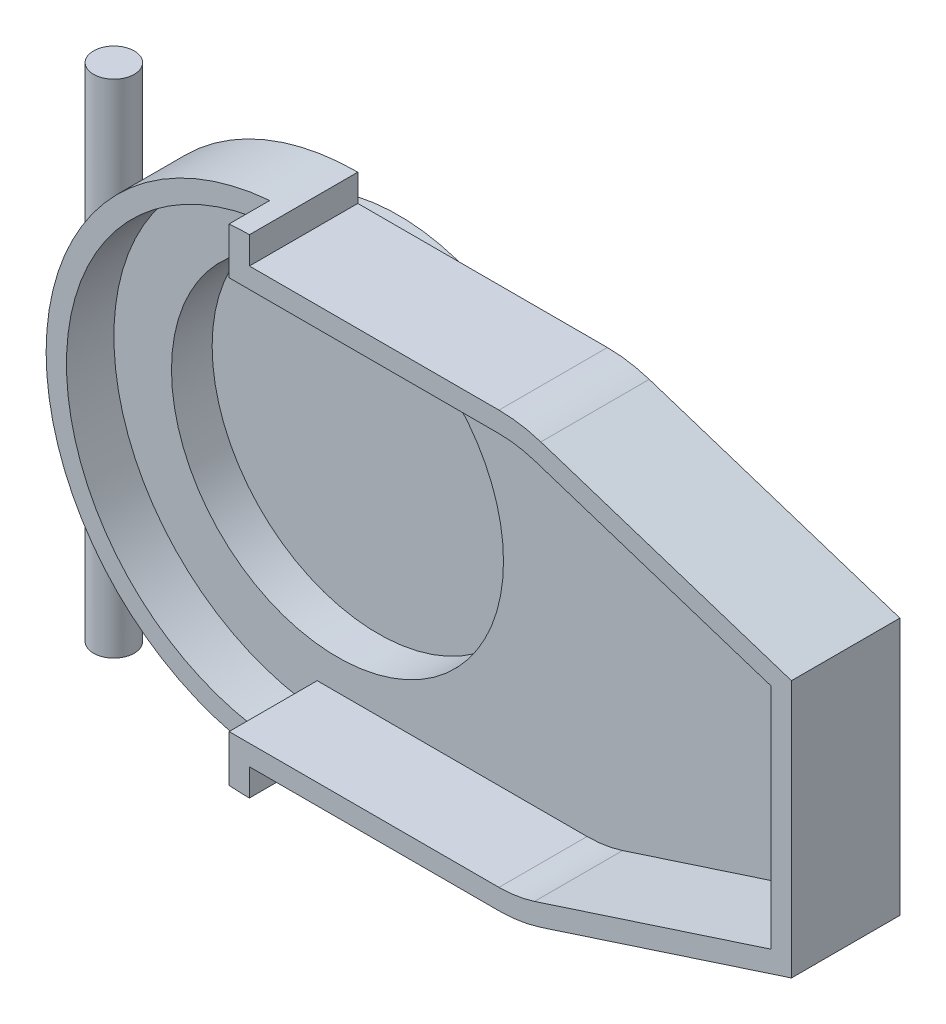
ISO-10303-21;
HEADER;
FILE_DESCRIPTION(('STEP AP214'),'2;1');
FILE_NAME('part.step','',(''),(''),'','','');
FILE_SCHEMA(('AUTOMOTIVE_DESIGN { 1 0 10303 214 1 1 1 1 }'));
ENDSEC;
DATA;
#1=APPLICATION_CONTEXT('core data for automotive mechanical design processes');
#2=APPLICATION_PROTOCOL_DEFINITION('international standard','automotive_design',2000,#1);
#3=PRODUCT_CONTEXT('',#1,'mechanical');
#4=PRODUCT('Part','Part','',(#3));
#5=PRODUCT_RELATED_PRODUCT_CATEGORY('part','',(#4));
#6=PRODUCT_DEFINITION_FORMATION('','',#4);
#7=PRODUCT_DEFINITION_CONTEXT('part definition',#1,'design');
#8=PRODUCT_DEFINITION('design','',#6,#7);
#9=PRODUCT_DEFINITION_SHAPE('','',#8);
#10=(LENGTH_UNIT() NAMED_UNIT(*) SI_UNIT(.MILLI.,.METRE.));
#11=(NAMED_UNIT(*) PLANE_ANGLE_UNIT() SI_UNIT($,.RADIAN.));
#12=(NAMED_UNIT(*) SI_UNIT($,.STERADIAN.) SOLID_ANGLE_UNIT());
#13=UNCERTAINTY_MEASURE_WITH_UNIT(LENGTH_MEASURE(1.E-05),#10,'distance_accuracy_value','');
#14=(GEOMETRIC_REPRESENTATION_CONTEXT(3) GLOBAL_UNCERTAINTY_ASSIGNED_CONTEXT((#13)) GLOBAL_UNIT_ASSIGNED_CONTEXT((#10,
#11,#12)) REPRESENTATION_CONTEXT('',''));
#15=CARTESIAN_POINT('',(0.,0.,0.));
#16=DIRECTION('',(0.,0.,1.));
#17=DIRECTION('',(1.,0.,0.));
#18=AXIS2_PLACEMENT_3D('',#15,#16,#17);
#19=CARTESIAN_POINT('',(0.,0.,10.9999999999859));
#20=DIRECTION('',(0.,0.,-1.));
#21=DIRECTION('',(-1.,0.,0.));
#22=AXIS2_PLACEMENT_3D('',#19,#20,#21);
#23=CYLINDRICAL_SURFACE('',#22,18.);
#24=CARTESIAN_POINT('',(0.,0.,10.9999999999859));
#25=DIRECTION('',(0.,0.,1.));
#26=DIRECTION('',(1.,0.,0.));
#27=AXIS2_PLACEMENT_3D('',#24,#25,#26);
#28=CIRCLE('',#27,18.);
#29=CARTESIAN_POINT('',(-1.5,-17.9373911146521,10.9999999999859));
#30=VERTEX_POINT('',#29);
#31=CARTESIAN_POINT('',(0.,-18.,10.9999999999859));
#32=VERTEX_POINT('',#31);
#33=EDGE_CURVE('E205',#30,#32,#28,.T.);
#34=ORIENTED_EDGE('',*,*,#33,.F.);
#35=DIRECTION('',(0.,0.,-1.));
#36=VECTOR('',#35,1.);
#37=CARTESIAN_POINT('',(-1.5,-17.9373911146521,10.9999999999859));
#38=LINE('',#37,#36);
#39=CARTESIAN_POINT('',(-1.5,-17.9373911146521,7.9999999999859));
#40=VERTEX_POINT('',#39);
#41=EDGE_CURVE('E197',#30,#40,#38,.T.);
#42=ORIENTED_EDGE('',*,*,#41,.T.);
#43=CARTESIAN_POINT('',(0.,0.,7.9999999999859));
#44=DIRECTION('',(0.,0.,-1.));
#45=DIRECTION('',(-1.,0.,0.));
#46=AXIS2_PLACEMENT_3D('',#43,#44,#45);
#47=CIRCLE('',#46,18.);
#48=CARTESIAN_POINT('',(-1.5,17.9373911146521,7.9999999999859));
#49=VERTEX_POINT('',#48);
#50=EDGE_CURVE('E183',#40,#49,#47,.T.);
#51=ORIENTED_EDGE('',*,*,#50,.T.);
#52=DIRECTION('',(0.,0.,-1.));
#53=VECTOR('',#52,1.);
#54=CARTESIAN_POINT('',(-1.5,17.9373911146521,10.9999999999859));
#55=LINE('',#54,#53);
#56=CARTESIAN_POINT('',(-1.5,17.9373911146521,10.9999999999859));
#57=VERTEX_POINT('',#56);
#58=EDGE_CURVE('E201',#49,#57,#55,.F.);
#59=ORIENTED_EDGE('',*,*,#58,.T.);
#60=CARTESIAN_POINT('',(0.,18.,10.9999999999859));
#61=VERTEX_POINT('',#60);
#62=EDGE_CURVE('E318',#61,#57,#28,.T.);
#63=ORIENTED_EDGE('',*,*,#62,.F.);
#64=DIRECTION('',(0.,0.,-1.));
#65=VECTOR('',#64,1.);
#66=CARTESIAN_POINT('',(0.,18.,10.9999999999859));
#67=LINE('',#66,#65);
#68=CARTESIAN_POINT('',(0.,18.,2.9999999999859));
#69=VERTEX_POINT('',#68);
#70=EDGE_CURVE('E334',#61,#69,#67,.T.);
#71=ORIENTED_EDGE('',*,*,#70,.T.);
#72=CARTESIAN_POINT('',(0.,0.,2.9999999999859));
#73=DIRECTION('',(0.,0.,1.));
#74=DIRECTION('',(1.,0.,0.));
#75=AXIS2_PLACEMENT_3D('',#72,#73,#74);
#76=CIRCLE('',#75,18.);
#77=CARTESIAN_POINT('',(0.,-18.,2.9999999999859));
#78=VERTEX_POINT('',#77);
#79=EDGE_CURVE('E297',#69,#78,#76,.T.);
#80=ORIENTED_EDGE('',*,*,#79,.T.);
#81=DIRECTION('',(0.,0.,-1.));
#82=VECTOR('',#81,1.);
#83=CARTESIAN_POINT('',(0.,-18.,10.9999999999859));
#84=LINE('',#83,#82);
#85=EDGE_CURVE('E331',#32,#78,#84,.T.);
#86=ORIENTED_EDGE('',*,*,#85,.F.);
#87=EDGE_LOOP('',(#34,#42,#51,#59,#63,#71,#80,#86));
#88=FACE_BOUND('',#87,.T.);
#89=CARTESIAN_POINT('',(-15.5,9.15150260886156,6.99999999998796));
#90=CARTESIAN_POINT('',(-15.4350245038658,9.26155332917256,6.99999762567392));
#91=CARTESIAN_POINT('',(-15.3688756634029,9.37090868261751,6.99579099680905));
#92=CARTESIAN_POINT('',(-15.2345694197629,9.58770806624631,6.97788420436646));
#93=CARTESIAN_POINT('',(-15.1664111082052,9.69515119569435,6.96417968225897));
#94=CARTESIAN_POINT('',(-15.0291509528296,9.90658424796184,6.92595522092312));
#95=CARTESIAN_POINT('',(-14.9600573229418,10.0105911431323,6.90150128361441));
#96=CARTESIAN_POINT('',(-14.8215769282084,10.214498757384,6.83995542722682));
#97=CARTESIAN_POINT('',(-14.7521907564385,10.3144053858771,6.80288246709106));
#98=CARTESIAN_POINT('',(-14.6321997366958,10.4836352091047,6.72501066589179));
#99=CARTESIAN_POINT('',(-14.5813033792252,10.5542780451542,6.68755332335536));
#100=CARTESIAN_POINT('',(-14.4812623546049,10.6911278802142,6.60293755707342));
#101=CARTESIAN_POINT('',(-14.4321198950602,10.7573293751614,6.55576738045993));
#102=CARTESIAN_POINT('',(-14.336820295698,10.8840218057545,6.44981805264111));
#103=CARTESIAN_POINT('',(-14.2907023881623,10.944441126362,6.39091574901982));
#104=CARTESIAN_POINT('',(-14.2048403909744,11.055650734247,6.26065751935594));
#105=CARTESIAN_POINT('',(-14.1650768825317,11.1064704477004,6.18934098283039));
#106=CARTESIAN_POINT('',(-14.1085420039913,11.1781177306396,6.06278556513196));
#107=CARTESIAN_POINT('',(-14.0886928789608,11.2031020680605,6.01127888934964));
#108=CARTESIAN_POINT('',(-14.0542751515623,11.246248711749,5.90379943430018));
#109=CARTESIAN_POINT('',(-14.0397025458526,11.2644161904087,5.84783008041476));
#110=CARTESIAN_POINT('',(-14.0168906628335,11.2927905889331,5.73213250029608));
#111=CARTESIAN_POINT('',(-14.0087022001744,11.3029336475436,5.67237812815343));
#112=CARTESIAN_POINT('',(-13.9996612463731,11.3141301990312,5.55147615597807));
#113=CARTESIAN_POINT('',(-13.9988046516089,11.3151887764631,5.49032935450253));
#114=CARTESIAN_POINT('',(-14.0041817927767,11.3085322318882,5.3756822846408));
#115=CARTESIAN_POINT('',(-14.0096412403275,11.3017752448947,5.3220847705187));
#116=CARTESIAN_POINT('',(-14.0259693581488,11.2815048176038,5.21705139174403));
#117=CARTESIAN_POINT('',(-14.0368390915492,11.2679900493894,5.16561595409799));
#118=CARTESIAN_POINT('',(-14.0636005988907,11.2345717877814,5.06460991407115));
#119=CARTESIAN_POINT('',(-14.0796225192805,11.2145024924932,5.01512976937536));
#120=CARTESIAN_POINT('',(-14.1156458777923,11.1691263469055,4.92021975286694));
#121=CARTESIAN_POINT('',(-14.1356491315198,11.1438171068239,4.87479174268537));
#122=CARTESIAN_POINT('',(-14.1919249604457,11.0721451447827,4.76175191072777));
#123=CARTESIAN_POINT('',(-14.230672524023,11.0223647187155,4.69753657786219));
#124=CARTESIAN_POINT('',(-14.313236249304,10.9149384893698,4.57978643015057));
#125=CARTESIAN_POINT('',(-14.3570663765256,10.8572709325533,4.52628219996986));
#126=CARTESIAN_POINT('',(-14.4378285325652,10.7495402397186,4.43957851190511));
#127=CARTESIAN_POINT('',(-14.474194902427,10.7005404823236,4.40449205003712));
#128=CARTESIAN_POINT('',(-14.5480715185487,10.5998832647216,4.33972208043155));
#129=CARTESIAN_POINT('',(-14.5855824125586,10.5482242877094,4.31004170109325));
#130=CARTESIAN_POINT('',(-14.6991063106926,10.3900455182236,4.22826955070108));
#131=CARTESIAN_POINT('',(-14.7760610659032,10.2803895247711,4.18349679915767));
#132=CARTESIAN_POINT('',(-14.9178497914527,10.073284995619,4.11570531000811));
#133=CARTESIAN_POINT('',(-14.982721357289,9.97656445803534,4.09039558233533));
#134=CARTESIAN_POINT('',(-15.1115196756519,9.78037499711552,4.04960429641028));
#135=CARTESIAN_POINT('',(-15.1754457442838,9.68090422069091,4.03412954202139));
#136=CARTESIAN_POINT('',(-15.3018281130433,9.47988329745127,4.01176189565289));
#137=CARTESIAN_POINT('',(-15.364281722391,9.37832989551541,4.00488367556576));
#138=CARTESIAN_POINT('',(-15.4872600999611,9.1738227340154,3.99879188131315));
#139=CARTESIAN_POINT('',(-15.5477843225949,9.07086858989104,3.99958045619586));
#140=CARTESIAN_POINT('',(-15.6957543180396,8.81333350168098,4.01017734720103));
#141=CARTESIAN_POINT('',(-15.7818732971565,8.65815416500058,4.02421255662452));
#142=CARTESIAN_POINT('',(-15.948789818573,8.34669862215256,4.06612570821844));
#143=CARTESIAN_POINT('',(-16.0295827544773,8.19042159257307,4.09401545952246));
#144=CARTESIAN_POINT('',(-16.1856318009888,7.87755746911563,4.16312951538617));
#145=CARTESIAN_POINT('',(-16.2608752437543,7.72097045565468,4.20438323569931));
#146=CARTESIAN_POINT('',(-16.3691032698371,7.48731174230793,4.27667301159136));
#147=CARTESIAN_POINT('',(-16.4043923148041,7.40966209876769,4.30249120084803));
#148=CARTESIAN_POINT('',(-16.4733794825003,7.25499342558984,4.35785645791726));
#149=CARTESIAN_POINT('',(-16.5070778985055,7.17797428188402,4.38740283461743));
#150=CARTESIAN_POINT('',(-16.5718597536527,7.02709134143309,4.44972410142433));
#151=CARTESIAN_POINT('',(-16.6029903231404,6.9532001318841,4.48238315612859));
#152=CARTESIAN_POINT('',(-16.663559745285,6.80676522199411,4.55222863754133));
#153=CARTESIAN_POINT('',(-16.6929971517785,6.73422270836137,4.58941885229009));
#154=CARTESIAN_POINT('',(-16.7497334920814,6.59183324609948,4.66901086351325));
#155=CARTESIAN_POINT('',(-16.7770447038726,6.52197222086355,4.71137843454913));
#156=CARTESIAN_POINT('',(-16.8292640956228,6.38601015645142,4.80297208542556));
#157=CARTESIAN_POINT('',(-16.8541773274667,6.31990133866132,4.85218318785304));
#158=CARTESIAN_POINT('',(-16.8926373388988,6.2161672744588,4.94140444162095));
#159=CARTESIAN_POINT('',(-16.9071362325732,6.17659560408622,4.97871453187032));
#160=CARTESIAN_POINT('',(-16.934152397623,6.10213331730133,5.05843609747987));
#161=CARTESIAN_POINT('',(-16.9466737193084,6.06723315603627,5.10083682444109));
#162=CARTESIAN_POINT('',(-16.9646180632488,6.0168237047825,5.17480816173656));
#163=CARTESIAN_POINT('',(-16.9709465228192,5.99893768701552,5.20451784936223));
#164=CARTESIAN_POINT('',(-16.9820356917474,5.96747358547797,5.26643011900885));
#165=CARTESIAN_POINT('',(-16.9867987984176,5.9538889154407,5.29862879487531));
#166=CARTESIAN_POINT('',(-16.9936412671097,5.93432777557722,5.35930118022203));
#167=CARTESIAN_POINT('',(-16.9960448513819,5.92743467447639,5.3874374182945));
#168=CARTESIAN_POINT('',(-16.9992459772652,5.91824814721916,5.44453622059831));
#169=CARTESIAN_POINT('',(-17.0000452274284,5.915949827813,5.4734978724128));
#170=CARTESIAN_POINT('',(-16.9999507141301,5.91622140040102,5.53143693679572));
#171=CARTESIAN_POINT('',(-16.9990545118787,5.91879830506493,5.56041431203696));
#172=CARTESIAN_POINT('',(-16.9956654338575,5.92852273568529,5.61749705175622));
#173=CARTESIAN_POINT('',(-16.9931708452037,5.93567516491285,5.64560144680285));
#174=CARTESIAN_POINT('',(-16.9857425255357,5.95690466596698,5.70959148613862));
#175=CARTESIAN_POINT('',(-16.9802697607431,5.97250402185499,5.74490244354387));
#176=CARTESIAN_POINT('',(-16.9674950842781,6.00870051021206,5.81248650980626));
#177=CARTESIAN_POINT('',(-16.9601887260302,6.02930978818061,5.8447519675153));
#178=CARTESIAN_POINT('',(-16.9380720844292,6.09126059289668,5.93030094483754));
#179=CARTESIAN_POINT('',(-16.9218339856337,6.1362930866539,5.98049899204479));
#180=CARTESIAN_POINT('',(-16.8867664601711,6.23215613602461,6.07390296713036));
#181=CARTESIAN_POINT('',(-16.8679286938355,6.28300525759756,6.11708537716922));
#182=CARTESIAN_POINT('',(-16.8199182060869,6.4106756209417,6.21552927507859));
#183=CARTESIAN_POINT('',(-16.7897841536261,6.4892640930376,6.26800206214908));
#184=CARTESIAN_POINT('',(-16.7267258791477,6.65012536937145,6.36514740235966));
#185=CARTESIAN_POINT('',(-16.6937961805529,6.73240524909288,6.40980409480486));
#186=CARTESIAN_POINT('',(-16.6254597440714,6.89943926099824,6.49310209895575));
#187=CARTESIAN_POINT('',(-16.5900429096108,6.98420255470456,6.53171656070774));
#188=CARTESIAN_POINT('',(-16.5171248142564,7.15494329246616,6.60366261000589));
#189=CARTESIAN_POINT('',(-16.4796251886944,7.24091974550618,6.63699826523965));
#190=CARTESIAN_POINT('',(-16.3738349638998,7.47828972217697,6.72225462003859));
#191=CARTESIAN_POINT('',(-16.3034997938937,7.63049634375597,6.76941822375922));
#192=CARTESIAN_POINT('',(-16.157139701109,7.93571333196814,6.85098865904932));
#193=CARTESIAN_POINT('',(-16.0811097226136,8.08872429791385,6.88538398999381));
#194=CARTESIAN_POINT('',(-15.9237240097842,8.39431600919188,6.94132950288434));
#195=CARTESIAN_POINT('',(-15.8423697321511,8.54689686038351,6.9628831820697));
#196=CARTESIAN_POINT('',(-15.6747326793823,8.85058156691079,6.99221497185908));
#197=CARTESIAN_POINT('',(-15.5884535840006,9.00168642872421,7.00000323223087));
#198=CARTESIAN_POINT('',(-15.5,9.15150260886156,6.99999999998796));
#199=B_SPLINE_CURVE_WITH_KNOTS('',3,(#89,#90,#91,#92,#93,#94,#95,#96,#97,#98,#99,#100,#101,#102,
#103,#104,#105,#106,#107,#108,#109,#110,#111,#112,#113,#114,#115,#116,#117,#118,#119,#120,#121,
#122,#123,#124,#125,#126,#127,#128,#129,#130,#131,#132,#133,#134,#135,#136,#137,#138,#139,#140,
#141,#142,#143,#144,#145,#146,#147,#148,#149,#150,#151,#152,#153,#154,#155,#156,#157,#158,#159,
#160,#161,#162,#163,#164,#165,#166,#167,#168,#169,#170,#171,#172,#173,#174,#175,#176,#177,#178,
#179,#180,#181,#182,#183,#184,#185,#186,#187,#188,#189,#190,#191,#192,#193,#194,#195,#196,#197,
#198),.UNSPECIFIED.,.T.,.F.,(4,2,2,2,2,2,2,2,2,2,2,2,2,2,2,2,2,2,2,2,2,2,2,2,2,2,2,2,2,2,2,2,2,
2,2,2,2,2,2,2,2,2,2,2,2,2,2,2,2,2,2,2,2,2,4),(0.,0.383303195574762,0.766782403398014,
1.14793922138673,1.52852589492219,1.81238746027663,2.09659454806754,2.38395915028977,
2.67042805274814,2.85154872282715,3.0325316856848,3.21494088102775,3.39724797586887,
3.55937668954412,3.72153727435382,3.88816682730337,4.05487254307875,4.32339325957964,
4.59267010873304,4.80354433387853,5.01454020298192,5.43681733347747,5.7939202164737,
6.15126987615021,6.50922860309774,6.86728767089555,7.4006461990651,7.93446012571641,
8.46945711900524,8.73672702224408,9.00394745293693,9.26356169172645,9.52339447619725,
9.78159413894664,10.0392373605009,10.2078165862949,10.376045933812,10.4815145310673,
10.5868208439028,10.6736531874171,10.7603930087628,10.8472576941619,10.9342156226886,
11.0505186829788,11.1671065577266,11.3740300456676,11.581633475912,11.8784921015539,
12.1759463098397,12.4746869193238,12.7731961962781,13.2950598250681,13.8173923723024,
14.3395826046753,14.8613876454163),.UNSPECIFIED.);
#200=CARTESIAN_POINT('',(-15.5,9.15150260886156,6.99999999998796));
#201=VERTEX_POINT('',#200);
#202=EDGE_CURVE('E487',#201,#201,#199,.T.);
#203=ORIENTED_EDGE('',*,*,#202,.F.);
#204=EDGE_LOOP('',(#203));
#205=FACE_BOUND('',#204,.T.);
#206=CARTESIAN_POINT('',(-15.5,-9.15150260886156,3.99999999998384));
#207=CARTESIAN_POINT('',(-15.4350245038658,-9.26155332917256,4.00000237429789));
#208=CARTESIAN_POINT('',(-15.3688756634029,-9.37090868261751,4.00420900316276));
#209=CARTESIAN_POINT('',(-15.2345694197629,-9.58770806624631,4.02211579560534));
#210=CARTESIAN_POINT('',(-15.1664111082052,-9.69515119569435,4.03582031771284));
#211=CARTESIAN_POINT('',(-15.0291509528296,-9.90658424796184,4.07404477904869));
#212=CARTESIAN_POINT('',(-14.9600573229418,-10.0105911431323,4.0984987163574));
#213=CARTESIAN_POINT('',(-14.8215769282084,-10.214498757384,4.16004457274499));
#214=CARTESIAN_POINT('',(-14.7521907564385,-10.3144053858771,4.19711753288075));
#215=CARTESIAN_POINT('',(-14.6321997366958,-10.4836352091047,4.27498933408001));
#216=CARTESIAN_POINT('',(-14.5813033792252,-10.5542780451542,4.31244667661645));
#217=CARTESIAN_POINT('',(-14.4812623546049,-10.6911278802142,4.39706244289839));
#218=CARTESIAN_POINT('',(-14.4321198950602,-10.7573293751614,4.44423261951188));
#219=CARTESIAN_POINT('',(-14.336820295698,-10.8840218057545,4.5501819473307));
#220=CARTESIAN_POINT('',(-14.2907023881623,-10.944441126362,4.60908425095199));
#221=CARTESIAN_POINT('',(-14.2048403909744,-11.055650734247,4.73934248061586));
#222=CARTESIAN_POINT('',(-14.1650768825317,-11.1064704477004,4.81065901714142));
#223=CARTESIAN_POINT('',(-14.1085420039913,-11.1781177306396,4.93721443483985));
#224=CARTESIAN_POINT('',(-14.0886928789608,-11.2031020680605,4.98872111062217));
#225=CARTESIAN_POINT('',(-14.0542751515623,-11.246248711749,5.09620056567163));
#226=CARTESIAN_POINT('',(-14.0397025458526,-11.2644161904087,5.15216991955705));
#227=CARTESIAN_POINT('',(-14.0168906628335,-11.2927905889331,5.26786749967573));
#228=CARTESIAN_POINT('',(-14.0087022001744,-11.3029336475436,5.32762187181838));
#229=CARTESIAN_POINT('',(-13.9996612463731,-11.3141301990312,5.44852384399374));
#230=CARTESIAN_POINT('',(-13.9988046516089,-11.3151887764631,5.50967064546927));
#231=CARTESIAN_POINT('',(-14.0041817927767,-11.3085322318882,5.62431771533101));
#232=CARTESIAN_POINT('',(-14.0096412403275,-11.3017752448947,5.6779152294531));
#233=CARTESIAN_POINT('',(-14.0259693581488,-11.2815048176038,5.78294860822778));
#234=CARTESIAN_POINT('',(-14.0368390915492,-11.2679900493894,5.83438404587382));
#235=CARTESIAN_POINT('',(-14.0636005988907,-11.2345717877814,5.93539008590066));
#236=CARTESIAN_POINT('',(-14.0796225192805,-11.2145024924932,5.98487023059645));
#237=CARTESIAN_POINT('',(-14.1156458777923,-11.1691263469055,6.07978024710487));
#238=CARTESIAN_POINT('',(-14.1356491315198,-11.1438171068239,6.12520825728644));
#239=CARTESIAN_POINT('',(-14.1919249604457,-11.0721451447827,6.23824808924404));
#240=CARTESIAN_POINT('',(-14.230672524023,-11.0223647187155,6.30246342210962));
#241=CARTESIAN_POINT('',(-14.313236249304,-10.9149384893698,6.42021356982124));
#242=CARTESIAN_POINT('',(-14.3570663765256,-10.8572709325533,6.47371780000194));
#243=CARTESIAN_POINT('',(-14.4378285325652,-10.7495402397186,6.5604214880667));
#244=CARTESIAN_POINT('',(-14.474194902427,-10.7005404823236,6.59550794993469));
#245=CARTESIAN_POINT('',(-14.5480715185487,-10.5998832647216,6.66027791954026));
#246=CARTESIAN_POINT('',(-14.5855824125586,-10.5482242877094,6.68995829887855));
#247=CARTESIAN_POINT('',(-14.6991063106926,-10.3900455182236,6.77173044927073));
#248=CARTESIAN_POINT('',(-14.7760610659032,-10.2803895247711,6.81650320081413));
#249=CARTESIAN_POINT('',(-14.9178497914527,-10.073284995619,6.8842946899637));
#250=CARTESIAN_POINT('',(-14.982721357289,-9.97656445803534,6.90960441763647));
#251=CARTESIAN_POINT('',(-15.1115196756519,-9.78037499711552,6.95039570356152));
#252=CARTESIAN_POINT('',(-15.1754457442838,-9.68090422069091,6.96587045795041));
#253=CARTESIAN_POINT('',(-15.3018281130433,-9.47988329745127,6.98823810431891));
#254=CARTESIAN_POINT('',(-15.364281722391,-9.37832989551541,6.99511632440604));
#255=CARTESIAN_POINT('',(-15.4872600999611,-9.1738227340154,7.00120811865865));
#256=CARTESIAN_POINT('',(-15.5477843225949,-9.07086858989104,7.00041954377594));
#257=CARTESIAN_POINT('',(-15.6957543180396,-8.81333350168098,6.98982265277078));
#258=CARTESIAN_POINT('',(-15.7818732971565,-8.65815416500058,6.97578744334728));
#259=CARTESIAN_POINT('',(-15.948789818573,-8.34669862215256,6.93387429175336));
#260=CARTESIAN_POINT('',(-16.0295827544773,-8.19042159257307,6.90598454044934));
#261=CARTESIAN_POINT('',(-16.1856318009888,-7.87755746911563,6.83687048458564));
#262=CARTESIAN_POINT('',(-16.2608752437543,-7.72097045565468,6.7956167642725));
#263=CARTESIAN_POINT('',(-16.3691032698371,-7.48731174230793,6.72332698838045));
#264=CARTESIAN_POINT('',(-16.4043923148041,-7.40966209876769,6.69750879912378));
#265=CARTESIAN_POINT('',(-16.4733794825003,-7.25499342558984,6.64214354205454));
#266=CARTESIAN_POINT('',(-16.5070778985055,-7.17797428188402,6.61259716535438));
#267=CARTESIAN_POINT('',(-16.5718597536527,-7.02709134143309,6.55027589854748));
#268=CARTESIAN_POINT('',(-16.6029903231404,-6.9532001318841,6.51761684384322));
#269=CARTESIAN_POINT('',(-16.663559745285,-6.80676522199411,6.44777136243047));
#270=CARTESIAN_POINT('',(-16.6929971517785,-6.73422270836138,6.41058114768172));
#271=CARTESIAN_POINT('',(-16.7497334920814,-6.59183324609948,6.33098913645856));
#272=CARTESIAN_POINT('',(-16.7770447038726,-6.52197222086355,6.28862156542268));
#273=CARTESIAN_POINT('',(-16.8292640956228,-6.38601015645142,6.19702791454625));
#274=CARTESIAN_POINT('',(-16.8541773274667,-6.31990133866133,6.14781681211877));
#275=CARTESIAN_POINT('',(-16.8926373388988,-6.2161672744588,6.05859555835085));
#276=CARTESIAN_POINT('',(-16.9071362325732,-6.17659560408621,6.02128546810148));
#277=CARTESIAN_POINT('',(-16.934152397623,-6.10213331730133,5.94156390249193));
#278=CARTESIAN_POINT('',(-16.9466737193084,-6.06723315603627,5.89916317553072));
#279=CARTESIAN_POINT('',(-16.9646180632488,-6.0168237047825,5.82519183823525));
#280=CARTESIAN_POINT('',(-16.9709465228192,-5.99893768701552,5.79548215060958));
#281=CARTESIAN_POINT('',(-16.9820356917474,-5.96747358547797,5.73356988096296));
#282=CARTESIAN_POINT('',(-16.9867987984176,-5.9538889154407,5.70137120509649));
#283=CARTESIAN_POINT('',(-16.9936412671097,-5.93432777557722,5.64069881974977));
#284=CARTESIAN_POINT('',(-16.9960448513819,-5.92743467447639,5.61256258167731));
#285=CARTESIAN_POINT('',(-16.9992459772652,-5.91824814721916,5.55546377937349));
#286=CARTESIAN_POINT('',(-17.0000452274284,-5.915949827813,5.526502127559));
#287=CARTESIAN_POINT('',(-16.9999507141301,-5.91622140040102,5.46856306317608));
#288=CARTESIAN_POINT('',(-16.9990545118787,-5.91879830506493,5.43958568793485));
#289=CARTESIAN_POINT('',(-16.9956654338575,-5.92852273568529,5.38250294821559));
#290=CARTESIAN_POINT('',(-16.9931708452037,-5.93567516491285,5.35439855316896));
#291=CARTESIAN_POINT('',(-16.9857425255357,-5.95690466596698,5.29040851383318));
#292=CARTESIAN_POINT('',(-16.9802697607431,-5.97250402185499,5.25509755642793));
#293=CARTESIAN_POINT('',(-16.9674950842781,-6.00870051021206,5.18751349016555));
#294=CARTESIAN_POINT('',(-16.9601887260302,-6.02930978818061,5.15524803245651));
#295=CARTESIAN_POINT('',(-16.9380720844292,-6.09126059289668,5.06969905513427));
#296=CARTESIAN_POINT('',(-16.9218339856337,-6.1362930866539,5.01950100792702));
#297=CARTESIAN_POINT('',(-16.8867664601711,-6.23215613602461,4.92609703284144));
#298=CARTESIAN_POINT('',(-16.8679286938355,-6.28300525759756,4.88291462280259));
#299=CARTESIAN_POINT('',(-16.8199182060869,-6.41067562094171,4.78447072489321));
#300=CARTESIAN_POINT('',(-16.7897841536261,-6.4892640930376,4.73199793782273));
#301=CARTESIAN_POINT('',(-16.7267258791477,-6.65012536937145,4.63485259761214));
#302=CARTESIAN_POINT('',(-16.6937961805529,-6.73240524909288,4.59019590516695));
#303=CARTESIAN_POINT('',(-16.6254597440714,-6.89943926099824,4.50689790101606));
#304=CARTESIAN_POINT('',(-16.5900429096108,-6.98420255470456,4.46828343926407));
#305=CARTESIAN_POINT('',(-16.5171248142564,-7.15494329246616,4.39633738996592));
#306=CARTESIAN_POINT('',(-16.4796251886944,-7.24091974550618,4.36300173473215));
#307=CARTESIAN_POINT('',(-16.3738349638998,-7.47828972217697,4.27774537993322));
#308=CARTESIAN_POINT('',(-16.3034997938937,-7.63049634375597,4.23058177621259));
#309=CARTESIAN_POINT('',(-16.157139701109,-7.93571333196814,4.14901134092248));
#310=CARTESIAN_POINT('',(-16.0811097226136,-8.08872429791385,4.114616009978));
#311=CARTESIAN_POINT('',(-15.9237240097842,-8.39431600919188,4.05867049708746));
#312=CARTESIAN_POINT('',(-15.8423697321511,-8.54689686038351,4.03711681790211));
#313=CARTESIAN_POINT('',(-15.6747326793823,-8.85058156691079,4.00778502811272));
#314=CARTESIAN_POINT('',(-15.5884535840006,-9.00168642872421,3.99999676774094));
#315=CARTESIAN_POINT('',(-15.5,-9.15150260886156,3.99999999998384));
#316=B_SPLINE_CURVE_WITH_KNOTS('',3,(#206,#207,#208,#209,#210,#211,#212,#213,#214,#215,#216,
#217,#218,#219,#220,#221,#222,#223,#224,#225,#226,#227,#228,#229,#230,#231,#232,#233,#234,#235,
#236,#237,#238,#239,#240,#241,#242,#243,#244,#245,#246,#247,#248,#249,#250,#251,#252,#253,#254,
#255,#256,#257,#258,#259,#260,#261,#262,#263,#264,#265,#266,#267,#268,#269,#270,#271,#272,#273,
#274,#275,#276,#277,#278,#279,#280,#281,#282,#283,#284,#285,#286,#287,#288,#289,#290,#291,#292,
#293,#294,#295,#296,#297,#298,#299,#300,#301,#302,#303,#304,#305,#306,#307,#308,#309,#310,#311,
#312,#313,#314,#315),.UNSPECIFIED.,.T.,.F.,(4,2,2,2,2,2,2,2,2,2,2,2,2,2,2,2,2,2,2,2,2,2,2,2,2,2,
2,2,2,2,2,2,2,2,2,2,2,2,2,2,2,2,2,2,2,2,2,2,2,2,2,2,2,2,4),(0.,0.383303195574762,
0.766782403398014,1.14793922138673,1.52852589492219,1.81238746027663,2.09659454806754,
2.38395915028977,2.67042805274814,2.85154872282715,3.0325316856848,3.21494088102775,
3.39724797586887,3.55937668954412,3.72153727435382,3.88816682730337,4.05487254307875,
4.32339325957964,4.59267010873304,4.80354433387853,5.01454020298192,5.43681733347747,
5.7939202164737,6.15126987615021,6.50922860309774,6.86728767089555,7.4006461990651,
7.93446012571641,8.46945711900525,8.73672702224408,9.00394745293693,9.26356169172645,
9.52339447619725,9.78159413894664,10.0392373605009,10.2078165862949,10.376045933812,
10.4815145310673,10.5868208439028,10.6736531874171,10.7603930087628,10.8472576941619,
10.9342156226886,11.0505186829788,11.1671065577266,11.3740300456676,11.581633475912,
11.8784921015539,12.1759463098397,12.4746869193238,12.7731961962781,13.2950598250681,
13.8173923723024,14.3395826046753,14.8613876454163),.UNSPECIFIED.);
#317=CARTESIAN_POINT('',(-15.5,-9.15150260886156,3.99999999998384));
#318=VERTEX_POINT('',#317);
#319=EDGE_CURVE('E11',#318,#318,#316,.T.);
#320=ORIENTED_EDGE('',*,*,#319,.F.);
#321=EDGE_LOOP('',(#320));
#322=FACE_BOUND('',#321,.T.);
#323=ADVANCED_FACE('F31',(#88,#205,#322),#23,.T.);
#324=CARTESIAN_POINT('',(18.4157833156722,-6.,10.9999999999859));
#325=DIRECTION('',(0.,0.,-1.));
#326=DIRECTION('',(-1.,0.,0.));
#327=AXIS2_PLACEMENT_3D('',#324,#325,#326);
#328=PLANE('',#327);
#329=ORIENTED_EDGE('',*,*,#62,.T.);
#330=DIRECTION('',(0.,1.,0.));
#331=VECTOR('',#330,1.);
#332=CARTESIAN_POINT('',(-1.5,-6.,10.9999999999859));
#333=LINE('',#332,#331);
#334=CARTESIAN_POINT('',(-1.5,14.5,10.9999999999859));
#335=VERTEX_POINT('',#334);
#336=EDGE_CURVE('E278',#335,#57,#333,.T.);
#337=ORIENTED_EDGE('',*,*,#336,.F.);
#338=DIRECTION('',(-1.,0.,0.));
#339=VECTOR('',#338,1.);
#340=CARTESIAN_POINT('',(18.4157833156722,14.5,10.9999999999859));
#341=LINE('',#340,#339);
#342=CARTESIAN_POINT('',(18.4157833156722,14.5,10.9999999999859));
#343=VERTEX_POINT('',#342);
#344=EDGE_CURVE('E276',#343,#335,#341,.T.);
#345=ORIENTED_EDGE('',*,*,#344,.F.);
#346=CARTESIAN_POINT('',(18.4157833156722,6.00000000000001,10.9999999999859));
#347=DIRECTION('',(0.,0.,-1.));
#348=DIRECTION('',(-1.,0.,0.));
#349=AXIS2_PLACEMENT_3D('',#346,#347,#348);
#350=CIRCLE('',#349,8.5);
#351=CARTESIAN_POINT('',(21.0430149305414,14.0837895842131,10.9999999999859));
#352=VERTEX_POINT('',#351);
#353=EDGE_CURVE('E274',#352,#343,#350,.F.);
#354=ORIENTED_EDGE('',*,*,#353,.F.);
#355=DIRECTION('',(-0.951034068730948,0.309086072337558,0.));
#356=VECTOR('',#355,1.);
#357=CARTESIAN_POINT('',(24.5704315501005,12.9373791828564,10.9999999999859));
#358=LINE('',#357,#356);
#359=CARTESIAN_POINT('',(38.5,8.41026943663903,10.9999999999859));
#360=VERTEX_POINT('',#359);
#361=EDGE_CURVE('E272',#360,#352,#358,.T.);
#362=ORIENTED_EDGE('',*,*,#361,.F.);
#363=DIRECTION('',(0.,1.,0.));
#364=VECTOR('',#363,1.);
#365=CARTESIAN_POINT('',(38.5,-6.,10.9999999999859));
#366=LINE('',#365,#364);
#367=CARTESIAN_POINT('',(38.5,-8.41026943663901,10.9999999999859));
#368=VERTEX_POINT('',#367);
#369=EDGE_CURVE('E270',#368,#360,#366,.T.);
#370=ORIENTED_EDGE('',*,*,#369,.F.);
#371=DIRECTION('',(0.951034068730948,0.309086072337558,0.));
#372=VECTOR('',#371,1.);
#373=CARTESIAN_POINT('',(21.0430149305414,-14.083789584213,10.9999999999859));
#374=LINE('',#373,#372);
#375=CARTESIAN_POINT('',(21.0430149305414,-14.083789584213,10.9999999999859));
#376=VERTEX_POINT('',#375);
#377=EDGE_CURVE('E268',#376,#368,#374,.T.);
#378=ORIENTED_EDGE('',*,*,#377,.F.);
#379=CARTESIAN_POINT('',(18.4157833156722,-6.,10.9999999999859));
#380=DIRECTION('',(0.,0.,-1.));
#381=DIRECTION('',(-1.,0.,0.));
#382=AXIS2_PLACEMENT_3D('',#379,#380,#381);
#383=CIRCLE('',#382,8.49999999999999);
#384=CARTESIAN_POINT('',(18.4157833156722,-14.5,10.9999999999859));
#385=VERTEX_POINT('',#384);
#386=EDGE_CURVE('E223',#385,#376,#383,.F.);
#387=ORIENTED_EDGE('',*,*,#386,.F.);
#388=DIRECTION('',(1.,0.,0.));
#389=VECTOR('',#388,1.);
#390=CARTESIAN_POINT('',(18.4157833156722,-14.5,10.9999999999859));
#391=LINE('',#390,#389);
#392=CARTESIAN_POINT('',(-1.5,-14.5,10.9999999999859));
#393=VERTEX_POINT('',#392);
#394=EDGE_CURVE('E249',#393,#385,#391,.T.);
#395=ORIENTED_EDGE('',*,*,#394,.F.);
#396=DIRECTION('',(0.,1.,0.));
#397=VECTOR('',#396,1.);
#398=CARTESIAN_POINT('',(-1.5,-6.,10.9999999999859));
#399=LINE('',#398,#397);
#400=EDGE_CURVE('E280',#30,#393,#399,.T.);
#401=ORIENTED_EDGE('',*,*,#400,.F.);
#402=ORIENTED_EDGE('',*,*,#33,.T.);
#403=DIRECTION('',(0.,1.,0.));
#404=VECTOR('',#403,1.);
#405=CARTESIAN_POINT('',(0.,-16.,10.9999999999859));
#406=LINE('',#405,#404);
#407=CARTESIAN_POINT('',(0.,-16.,10.9999999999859));
#408=VERTEX_POINT('',#407);
#409=EDGE_CURVE('E321',#32,#408,#406,.T.);
#410=ORIENTED_EDGE('',*,*,#409,.T.);
#411=DIRECTION('',(1.,0.,0.));
#412=VECTOR('',#411,1.);
#413=CARTESIAN_POINT('',(0.,-16.,10.9999999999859));
#414=LINE('',#413,#412);
#415=CARTESIAN_POINT('',(18.4157833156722,-16.,10.9999999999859));
#416=VERTEX_POINT('',#415);
#417=EDGE_CURVE('E323',#408,#416,#414,.T.);
#418=ORIENTED_EDGE('',*,*,#417,.T.);
#419=CARTESIAN_POINT('',(18.4157833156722,-6.,10.9999999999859));
#420=DIRECTION('',(0.,0.,1.));
#421=DIRECTION('',(-1.,0.,0.));
#422=AXIS2_PLACEMENT_3D('',#419,#420,#421);
#423=CIRCLE('',#422,9.99999999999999);
#424=CARTESIAN_POINT('',(21.5066440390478,-15.5103406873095,10.9999999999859));
#425=VERTEX_POINT('',#424);
#426=EDGE_CURVE('E303',#416,#425,#423,.T.);
#427=ORIENTED_EDGE('',*,*,#426,.T.);
#428=DIRECTION('',(0.951034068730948,0.309086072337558,0.));
#429=VECTOR('',#428,1.);
#430=CARTESIAN_POINT('',(21.5066440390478,-15.5103406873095,10.9999999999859));
#431=LINE('',#430,#429);
#432=CARTESIAN_POINT('',(40.,-9.49999999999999,10.9999999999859));
#433=VERTEX_POINT('',#432);
#434=EDGE_CURVE('E306',#425,#433,#431,.T.);
#435=ORIENTED_EDGE('',*,*,#434,.T.);
#436=DIRECTION('',(0.,1.,0.));
#437=VECTOR('',#436,1.);
#438=CARTESIAN_POINT('',(40.,-9.49999999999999,10.9999999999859));
#439=LINE('',#438,#437);
#440=CARTESIAN_POINT('',(40.,9.50000000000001,10.9999999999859));
#441=VERTEX_POINT('',#440);
#442=EDGE_CURVE('E308',#433,#441,#439,.T.);
#443=ORIENTED_EDGE('',*,*,#442,.T.);
#444=DIRECTION('',(-0.951034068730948,0.309086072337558,0.));
#445=VECTOR('',#444,1.);
#446=CARTESIAN_POINT('',(21.5066440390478,15.5103406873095,10.9999999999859));
#447=LINE('',#446,#445);
#448=CARTESIAN_POINT('',(21.5066440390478,15.5103406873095,10.9999999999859));
#449=VERTEX_POINT('',#448);
#450=EDGE_CURVE('E310',#441,#449,#447,.T.);
#451=ORIENTED_EDGE('',*,*,#450,.T.);
#452=CARTESIAN_POINT('',(18.4157833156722,6.00000000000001,10.9999999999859));
#453=DIRECTION('',(0.,0.,1.));
#454=DIRECTION('',(1.,0.,0.));
#455=AXIS2_PLACEMENT_3D('',#452,#453,#454);
#456=CIRCLE('',#455,10.);
#457=CARTESIAN_POINT('',(18.4157833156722,16.,10.9999999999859));
#458=VERTEX_POINT('',#457);
#459=EDGE_CURVE('E312',#449,#458,#456,.T.);
#460=ORIENTED_EDGE('',*,*,#459,.T.);
#461=DIRECTION('',(-1.,0.,0.));
#462=VECTOR('',#461,1.);
#463=CARTESIAN_POINT('',(0.,16.,10.9999999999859));
#464=LINE('',#463,#462);
#465=CARTESIAN_POINT('',(0.,16.,10.9999999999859));
#466=VERTEX_POINT('',#465);
#467=EDGE_CURVE('E314',#458,#466,#464,.T.);
#468=ORIENTED_EDGE('',*,*,#467,.T.);
#469=DIRECTION('',(0.,1.,0.));
#470=VECTOR('',#469,1.);
#471=CARTESIAN_POINT('',(0.,16.,10.9999999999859));
#472=LINE('',#471,#470);
#473=EDGE_CURVE('E316',#466,#61,#472,.T.);
#474=ORIENTED_EDGE('',*,*,#473,.T.);
#475=EDGE_LOOP('',(#329,#337,#345,#354,#362,#370,#378,#387,#395,#401,#402,#410,#418,#427,#435,
#443,#451,#460,#468,#474));
#476=FACE_BOUND('',#475,.T.);
#477=ADVANCED_FACE('F365',(#476),#328,.F.);
#478=CARTESIAN_POINT('',(0.,0.,3.));
#479=DIRECTION('',(0.,0.,-1.));
#480=DIRECTION('',(-1.,0.,0.));
#481=AXIS2_PLACEMENT_3D('',#478,#479,#480);
#482=CYLINDRICAL_SURFACE('',#481,13.75);
#483=CARTESIAN_POINT('',(0.,0.,3.));
#484=DIRECTION('',(0.,0.,1.));
#485=DIRECTION('',(1.,0.,0.));
#486=AXIS2_PLACEMENT_3D('',#483,#484,#485);
#487=CIRCLE('',#486,13.75);
#488=CARTESIAN_POINT('',(13.75,0.,3.));
#489=VERTEX_POINT('',#488);
#490=EDGE_CURVE('E43',#489,#489,#487,.T.);
#491=ORIENTED_EDGE('',*,*,#490,.F.);
#492=EDGE_LOOP('',(#491));
#493=FACE_BOUND('',#492,.T.);
#494=CARTESIAN_POINT('',(0.,0.,0.));
#495=DIRECTION('',(0.,0.,1.));
#496=DIRECTION('',(1.,0.,0.));
#497=AXIS2_PLACEMENT_3D('',#494,#495,#496);
#498=CIRCLE('',#497,13.75);
#499=CARTESIAN_POINT('',(13.75,0.,0.));
#500=VERTEX_POINT('',#499);
#501=EDGE_CURVE('E355',#500,#500,#498,.T.);
#502=ORIENTED_EDGE('',*,*,#501,.T.);
#503=EDGE_LOOP('',(#502));
#504=FACE_BOUND('',#503,.T.);
#505=ADVANCED_FACE('F33',(#493,#504),#482,.T.);
#506=CARTESIAN_POINT('',(0.,0.,0.));
#507=DIRECTION('',(0.,0.,1.));
#508=DIRECTION('',(1.,0.,0.));
#509=AXIS2_PLACEMENT_3D('',#506,#507,#508);
#510=PLANE('',#509);
#511=ORIENTED_EDGE('',*,*,#501,.F.);
#512=EDGE_LOOP('',(#511));
#513=FACE_BOUND('',#512,.T.);
#514=ADVANCED_FACE('F364',(#513),#510,.F.);
#515=CARTESIAN_POINT('',(18.4157833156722,-6.,2.9999999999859));
#516=DIRECTION('',(0.,0.,-1.));
#517=DIRECTION('',(-1.,0.,0.));
#518=AXIS2_PLACEMENT_3D('',#515,#516,#517);
#519=PLANE('',#518);
#520=CARTESIAN_POINT('',(18.4157833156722,-6.,2.9999999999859));
#521=DIRECTION('',(0.,0.,1.));
#522=DIRECTION('',(-1.,0.,0.));
#523=AXIS2_PLACEMENT_3D('',#520,#521,#522);
#524=CIRCLE('',#523,9.99999999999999);
#525=CARTESIAN_POINT('',(18.4157833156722,-16.,2.9999999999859));
#526=VERTEX_POINT('',#525);
#527=CARTESIAN_POINT('',(21.5066440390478,-15.5103406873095,2.9999999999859));
#528=VERTEX_POINT('',#527);
#529=EDGE_CURVE('E213',#526,#528,#524,.T.);
#530=ORIENTED_EDGE('',*,*,#529,.F.);
#531=DIRECTION('',(1.,0.,0.));
#532=VECTOR('',#531,1.);
#533=CARTESIAN_POINT('',(0.,-16.,2.9999999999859));
#534=LINE('',#533,#532);
#535=CARTESIAN_POINT('',(0.,-16.,2.9999999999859));
#536=VERTEX_POINT('',#535);
#537=EDGE_CURVE('E301',#536,#526,#534,.T.);
#538=ORIENTED_EDGE('',*,*,#537,.F.);
#539=DIRECTION('',(0.,1.,0.));
#540=VECTOR('',#539,1.);
#541=CARTESIAN_POINT('',(0.,-16.,2.9999999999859));
#542=LINE('',#541,#540);
#543=EDGE_CURVE('E299',#78,#536,#542,.T.);
#544=ORIENTED_EDGE('',*,*,#543,.F.);
#545=ORIENTED_EDGE('',*,*,#79,.F.);
#546=DIRECTION('',(0.,1.,0.));
#547=VECTOR('',#546,1.);
#548=CARTESIAN_POINT('',(0.,16.,2.9999999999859));
#549=LINE('',#548,#547);
#550=CARTESIAN_POINT('',(0.,16.,2.9999999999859));
#551=VERTEX_POINT('',#550);
#552=EDGE_CURVE('E295',#551,#69,#549,.T.);
#553=ORIENTED_EDGE('',*,*,#552,.F.);
#554=DIRECTION('',(-1.,0.,0.));
#555=VECTOR('',#554,1.);
#556=CARTESIAN_POINT('',(0.,16.,2.9999999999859));
#557=LINE('',#556,#555);
#558=CARTESIAN_POINT('',(18.4157833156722,16.,2.9999999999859));
#559=VERTEX_POINT('',#558);
#560=EDGE_CURVE('E293',#559,#551,#557,.T.);
#561=ORIENTED_EDGE('',*,*,#560,.F.);
#562=CARTESIAN_POINT('',(18.4157833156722,6.00000000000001,2.9999999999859));
#563=DIRECTION('',(0.,0.,1.));
#564=DIRECTION('',(1.,0.,0.));
#565=AXIS2_PLACEMENT_3D('',#562,#563,#564);
#566=CIRCLE('',#565,10.);
#567=CARTESIAN_POINT('',(21.5066440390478,15.5103406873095,2.9999999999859));
#568=VERTEX_POINT('',#567);
#569=EDGE_CURVE('E291',#568,#559,#566,.T.);
#570=ORIENTED_EDGE('',*,*,#569,.F.);
#571=DIRECTION('',(-0.951034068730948,0.309086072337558,0.));
#572=VECTOR('',#571,1.);
#573=CARTESIAN_POINT('',(21.5066440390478,15.5103406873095,2.9999999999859));
#574=LINE('',#573,#572);
#575=CARTESIAN_POINT('',(40.,9.50000000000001,2.9999999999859));
#576=VERTEX_POINT('',#575);
#577=EDGE_CURVE('E289',#576,#568,#574,.T.);
#578=ORIENTED_EDGE('',*,*,#577,.F.);
#579=DIRECTION('',(0.,1.,0.));
#580=VECTOR('',#579,1.);
#581=CARTESIAN_POINT('',(40.,-9.49999999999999,2.9999999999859));
#582=LINE('',#581,#580);
#583=CARTESIAN_POINT('',(40.,-9.49999999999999,2.9999999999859));
#584=VERTEX_POINT('',#583);
#585=EDGE_CURVE('E287',#584,#576,#582,.T.);
#586=ORIENTED_EDGE('',*,*,#585,.F.);
#587=DIRECTION('',(0.951034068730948,0.309086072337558,0.));
#588=VECTOR('',#587,1.);
#589=CARTESIAN_POINT('',(21.5066440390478,-15.5103406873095,2.9999999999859));
#590=LINE('',#589,#588);
#591=EDGE_CURVE('E285',#528,#584,#590,.T.);
#592=ORIENTED_EDGE('',*,*,#591,.F.);
#593=EDGE_LOOP('',(#530,#538,#544,#545,#553,#561,#570,#578,#586,#592));
#594=FACE_BOUND('',#593,.T.);
#595=ORIENTED_EDGE('',*,*,#490,.T.);
#596=EDGE_LOOP('',(#595));
#597=FACE_BOUND('',#596,.T.);
#598=ADVANCED_FACE('F360',(#594,#597),#519,.T.);
#599=CARTESIAN_POINT('',(18.4157833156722,-6.,10.9999999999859));
#600=DIRECTION('',(0.,0.,-1.));
#601=DIRECTION('',(-1.,0.,0.));
#602=AXIS2_PLACEMENT_3D('',#599,#600,#601);
#603=CYLINDRICAL_SURFACE('',#602,9.99999999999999);
#604=ORIENTED_EDGE('',*,*,#529,.T.);
#605=DIRECTION('',(0.,0.,-1.));
#606=VECTOR('',#605,1.);
#607=CARTESIAN_POINT('',(21.5066440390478,-15.5103406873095,10.9999999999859));
#608=LINE('',#607,#606);
#609=EDGE_CURVE('E352',#425,#528,#608,.T.);
#610=ORIENTED_EDGE('',*,*,#609,.F.);
#611=ORIENTED_EDGE('',*,*,#426,.F.);
#612=DIRECTION('',(0.,0.,-1.));
#613=VECTOR('',#612,1.);
#614=CARTESIAN_POINT('',(18.4157833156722,-16.,10.9999999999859));
#615=LINE('',#614,#613);
#616=EDGE_CURVE('E325',#416,#526,#615,.T.);
#617=ORIENTED_EDGE('',*,*,#616,.T.);
#618=EDGE_LOOP('',(#604,#610,#611,#617));
#619=FACE_BOUND('',#618,.T.);
#620=ADVANCED_FACE('F372',(#619),#603,.T.);
#621=CARTESIAN_POINT('',(21.5066440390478,-15.5103406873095,10.9999999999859));
#622=DIRECTION('',(-0.309086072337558,0.951034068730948,0.));
#623=DIRECTION('',(-0.951034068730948,-0.309086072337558,0.));
#624=AXIS2_PLACEMENT_3D('',#621,#622,#623);
#625=PLANE('',#624);
#626=ORIENTED_EDGE('',*,*,#591,.T.);
#627=DIRECTION('',(0.,0.,-1.));
#628=VECTOR('',#627,1.);
#629=CARTESIAN_POINT('',(40.,-9.49999999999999,10.9999999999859));
#630=LINE('',#629,#628);
#631=EDGE_CURVE('E349',#433,#584,#630,.T.);
#632=ORIENTED_EDGE('',*,*,#631,.F.);
#633=ORIENTED_EDGE('',*,*,#434,.F.);
#634=ORIENTED_EDGE('',*,*,#609,.T.);
#635=EDGE_LOOP('',(#626,#632,#633,#634));
#636=FACE_BOUND('',#635,.T.);
#637=ADVANCED_FACE('F406',(#636),#625,.F.);
#638=CARTESIAN_POINT('',(40.,-9.49999999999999,10.9999999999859));
#639=DIRECTION('',(-1.,0.,0.));
#640=DIRECTION('',(0.,0.,1.));
#641=AXIS2_PLACEMENT_3D('',#638,#639,#640);
#642=PLANE('',#641);
#643=ORIENTED_EDGE('',*,*,#585,.T.);
#644=DIRECTION('',(0.,0.,-1.));
#645=VECTOR('',#644,1.);
#646=CARTESIAN_POINT('',(40.,9.50000000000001,10.9999999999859));
#647=LINE('',#646,#645);
#648=EDGE_CURVE('E346',#441,#576,#647,.T.);
#649=ORIENTED_EDGE('',*,*,#648,.F.);
#650=ORIENTED_EDGE('',*,*,#442,.F.);
#651=ORIENTED_EDGE('',*,*,#631,.T.);
#652=EDGE_LOOP('',(#643,#649,#650,#651));
#653=FACE_BOUND('',#652,.T.);
#654=ADVANCED_FACE('F402',(#653),#642,.F.);
#655=CARTESIAN_POINT('',(21.5066440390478,15.5103406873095,10.9999999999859));
#656=DIRECTION('',(-0.309086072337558,-0.951034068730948,0.));
#657=DIRECTION('',(0.951034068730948,-0.309086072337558,0.));
#658=AXIS2_PLACEMENT_3D('',#655,#656,#657);
#659=PLANE('',#658);
#660=ORIENTED_EDGE('',*,*,#577,.T.);
#661=DIRECTION('',(0.,0.,-1.));
#662=VECTOR('',#661,1.);
#663=CARTESIAN_POINT('',(21.5066440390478,15.5103406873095,10.9999999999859));
#664=LINE('',#663,#662);
#665=EDGE_CURVE('E343',#449,#568,#664,.T.);
#666=ORIENTED_EDGE('',*,*,#665,.F.);
#667=ORIENTED_EDGE('',*,*,#450,.F.);
#668=ORIENTED_EDGE('',*,*,#648,.T.);
#669=EDGE_LOOP('',(#660,#666,#667,#668));
#670=FACE_BOUND('',#669,.T.);
#671=ADVANCED_FACE('F398',(#670),#659,.F.);
#672=CARTESIAN_POINT('',(18.4157833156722,6.00000000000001,10.9999999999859));
#673=DIRECTION('',(0.,0.,-1.));
#674=DIRECTION('',(-1.,0.,0.));
#675=AXIS2_PLACEMENT_3D('',#672,#673,#674);
#676=CYLINDRICAL_SURFACE('',#675,10.);
#677=ORIENTED_EDGE('',*,*,#569,.T.);
#678=DIRECTION('',(0.,0.,-1.));
#679=VECTOR('',#678,1.);
#680=CARTESIAN_POINT('',(18.4157833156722,16.,10.9999999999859));
#681=LINE('',#680,#679);
#682=EDGE_CURVE('E340',#458,#559,#681,.T.);
#683=ORIENTED_EDGE('',*,*,#682,.F.);
#684=ORIENTED_EDGE('',*,*,#459,.F.);
#685=ORIENTED_EDGE('',*,*,#665,.T.);
#686=EDGE_LOOP('',(#677,#683,#684,#685));
#687=FACE_BOUND('',#686,.T.);
#688=ADVANCED_FACE('F394',(#687),#676,.T.);
#689=CARTESIAN_POINT('',(0.,16.,10.9999999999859));
#690=DIRECTION('',(0.,-1.,0.));
#691=DIRECTION('',(1.,0.,0.));
#692=AXIS2_PLACEMENT_3D('',#689,#690,#691);
#693=PLANE('',#692);
#694=ORIENTED_EDGE('',*,*,#560,.T.);
#695=DIRECTION('',(0.,0.,-1.));
#696=VECTOR('',#695,1.);
#697=CARTESIAN_POINT('',(0.,16.,10.9999999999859));
#698=LINE('',#697,#696);
#699=EDGE_CURVE('E337',#466,#551,#698,.T.);
#700=ORIENTED_EDGE('',*,*,#699,.F.);
#701=ORIENTED_EDGE('',*,*,#467,.F.);
#702=ORIENTED_EDGE('',*,*,#682,.T.);
#703=EDGE_LOOP('',(#694,#700,#701,#702));
#704=FACE_BOUND('',#703,.T.);
#705=ADVANCED_FACE('F390',(#704),#693,.F.);
#706=CARTESIAN_POINT('',(0.,16.,10.9999999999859));
#707=DIRECTION('',(-1.,0.,0.));
#708=DIRECTION('',(0.,0.,1.));
#709=AXIS2_PLACEMENT_3D('',#706,#707,#708);
#710=PLANE('',#709);
#711=ORIENTED_EDGE('',*,*,#552,.T.);
#712=ORIENTED_EDGE('',*,*,#70,.F.);
#713=ORIENTED_EDGE('',*,*,#473,.F.);
#714=ORIENTED_EDGE('',*,*,#699,.T.);
#715=EDGE_LOOP('',(#711,#712,#713,#714));
#716=FACE_BOUND('',#715,.T.);
#717=ADVANCED_FACE('F387',(#716),#710,.F.);
#718=CARTESIAN_POINT('',(0.,-16.,10.9999999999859));
#719=DIRECTION('',(-1.,0.,0.));
#720=DIRECTION('',(0.,0.,1.));
#721=AXIS2_PLACEMENT_3D('',#718,#719,#720);
#722=PLANE('',#721);
#723=ORIENTED_EDGE('',*,*,#543,.T.);
#724=DIRECTION('',(0.,0.,-1.));
#725=VECTOR('',#724,1.);
#726=CARTESIAN_POINT('',(0.,-16.,10.9999999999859));
#727=LINE('',#726,#725);
#728=EDGE_CURVE('E328',#408,#536,#727,.T.);
#729=ORIENTED_EDGE('',*,*,#728,.F.);
#730=ORIENTED_EDGE('',*,*,#409,.F.);
#731=ORIENTED_EDGE('',*,*,#85,.T.);
#732=EDGE_LOOP('',(#723,#729,#730,#731));
#733=FACE_BOUND('',#732,.T.);
#734=ADVANCED_FACE('F385',(#733),#722,.F.);
#735=CARTESIAN_POINT('',(0.,-16.,10.9999999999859));
#736=DIRECTION('',(0.,1.,0.));
#737=DIRECTION('',(0.,0.,1.));
#738=AXIS2_PLACEMENT_3D('',#735,#736,#737);
#739=PLANE('',#738);
#740=ORIENTED_EDGE('',*,*,#537,.T.);
#741=ORIENTED_EDGE('',*,*,#616,.F.);
#742=ORIENTED_EDGE('',*,*,#417,.F.);
#743=ORIENTED_EDGE('',*,*,#728,.T.);
#744=EDGE_LOOP('',(#740,#741,#742,#743));
#745=FACE_BOUND('',#744,.T.);
#746=ADVANCED_FACE('F428',(#745),#739,.F.);
#747=CARTESIAN_POINT('',(0.,0.,3.));
#748=DIRECTION('',(0.,0.,-1.));
#749=DIRECTION('',(-1.,0.,0.));
#750=AXIS2_PLACEMENT_3D('',#747,#748,#749);
#751=CYLINDRICAL_SURFACE('',#750,12.25);
#752=CARTESIAN_POINT('',(0.,0.,4.4999999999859));
#753=DIRECTION('',(0.,0.,-1.));
#754=DIRECTION('',(-1.,0.,0.));
#755=AXIS2_PLACEMENT_3D('',#752,#753,#754);
#756=CIRCLE('',#755,12.25);
#757=CARTESIAN_POINT('',(-12.25,0.,4.4999999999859));
#758=VERTEX_POINT('',#757);
#759=EDGE_CURVE('E210',#758,#758,#756,.F.);
#760=ORIENTED_EDGE('',*,*,#759,.T.);
#761=EDGE_LOOP('',(#760));
#762=FACE_BOUND('',#761,.T.);
#763=CARTESIAN_POINT('',(0.,0.,1.5));
#764=DIRECTION('',(0.,0.,1.));
#765=DIRECTION('',(1.,0.,0.));
#766=AXIS2_PLACEMENT_3D('',#763,#764,#765);
#767=CIRCLE('',#766,12.25);
#768=CARTESIAN_POINT('',(12.25,0.,1.5));
#769=VERTEX_POINT('',#768);
#770=EDGE_CURVE('E214',#769,#769,#767,.T.);
#771=ORIENTED_EDGE('',*,*,#770,.F.);
#772=EDGE_LOOP('',(#771));
#773=FACE_BOUND('',#772,.T.);
#774=ADVANCED_FACE('F660',(#762,#773),#751,.F.);
#775=CARTESIAN_POINT('',(0.,0.,1.5));
#776=DIRECTION('',(0.,0.,1.));
#777=DIRECTION('',(1.,0.,0.));
#778=AXIS2_PLACEMENT_3D('',#775,#776,#777);
#779=PLANE('',#778);
#780=ORIENTED_EDGE('',*,*,#770,.T.);
#781=EDGE_LOOP('',(#780));
#782=FACE_BOUND('',#781,.T.);
#783=ADVANCED_FACE('F651',(#782),#779,.T.);
#784=CARTESIAN_POINT('',(18.4157833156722,-6.,4.4999999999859));
#785=DIRECTION('',(0.,0.,-1.));
#786=DIRECTION('',(-1.,0.,0.));
#787=AXIS2_PLACEMENT_3D('',#784,#785,#786);
#788=PLANE('',#787);
#789=CARTESIAN_POINT('',(18.4157833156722,-6.,4.4999999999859));
#790=DIRECTION('',(0.,0.,-1.));
#791=DIRECTION('',(-1.,0.,0.));
#792=AXIS2_PLACEMENT_3D('',#789,#790,#791);
#793=CIRCLE('',#792,8.49999999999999);
#794=CARTESIAN_POINT('',(18.4157833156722,-14.5,4.4999999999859));
#795=VERTEX_POINT('',#794);
#796=CARTESIAN_POINT('',(21.0430149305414,-14.083789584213,4.4999999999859));
#797=VERTEX_POINT('',#796);
#798=EDGE_CURVE('E190',#795,#797,#793,.F.);
#799=ORIENTED_EDGE('',*,*,#798,.T.);
#800=DIRECTION('',(0.951034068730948,0.309086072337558,0.));
#801=VECTOR('',#800,1.);
#802=CARTESIAN_POINT('',(21.0430149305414,-14.083789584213,4.4999999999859));
#803=LINE('',#802,#801);
#804=CARTESIAN_POINT('',(38.5,-8.41026943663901,4.4999999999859));
#805=VERTEX_POINT('',#804);
#806=EDGE_CURVE('E220',#797,#805,#803,.T.);
#807=ORIENTED_EDGE('',*,*,#806,.T.);
#808=DIRECTION('',(0.,1.,0.));
#809=VECTOR('',#808,1.);
#810=CARTESIAN_POINT('',(38.5,-6.,4.4999999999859));
#811=LINE('',#810,#809);
#812=CARTESIAN_POINT('',(38.5,8.41026943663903,4.4999999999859));
#813=VERTEX_POINT('',#812);
#814=EDGE_CURVE('E240',#805,#813,#811,.T.);
#815=ORIENTED_EDGE('',*,*,#814,.T.);
#816=DIRECTION('',(-0.951034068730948,0.309086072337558,0.));
#817=VECTOR('',#816,1.);
#818=CARTESIAN_POINT('',(24.5704315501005,12.9373791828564,4.4999999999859));
#819=LINE('',#818,#817);
#820=CARTESIAN_POINT('',(21.0430149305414,14.0837895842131,4.4999999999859));
#821=VERTEX_POINT('',#820);
#822=EDGE_CURVE('E238',#813,#821,#819,.T.);
#823=ORIENTED_EDGE('',*,*,#822,.T.);
#824=CARTESIAN_POINT('',(18.4157833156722,6.00000000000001,4.4999999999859));
#825=DIRECTION('',(0.,0.,-1.));
#826=DIRECTION('',(-1.,0.,0.));
#827=AXIS2_PLACEMENT_3D('',#824,#825,#826);
#828=CIRCLE('',#827,8.5);
#829=CARTESIAN_POINT('',(18.4157833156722,14.5,4.4999999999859));
#830=VERTEX_POINT('',#829);
#831=EDGE_CURVE('E236',#821,#830,#828,.F.);
#832=ORIENTED_EDGE('',*,*,#831,.T.);
#833=DIRECTION('',(-1.,0.,0.));
#834=VECTOR('',#833,1.);
#835=CARTESIAN_POINT('',(18.4157833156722,14.5,4.4999999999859));
#836=LINE('',#835,#834);
#837=CARTESIAN_POINT('',(-1.5,14.5,4.4999999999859));
#838=VERTEX_POINT('',#837);
#839=EDGE_CURVE('E233',#830,#838,#836,.T.);
#840=ORIENTED_EDGE('',*,*,#839,.T.);
#841=DIRECTION('',(0.,1.,0.));
#842=VECTOR('',#841,1.);
#843=CARTESIAN_POINT('',(-1.5,-6.,4.4999999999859));
#844=LINE('',#843,#842);
#845=CARTESIAN_POINT('',(-1.5,16.431676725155,4.4999999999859));
#846=VERTEX_POINT('',#845);
#847=EDGE_CURVE('E230',#838,#846,#844,.T.);
#848=ORIENTED_EDGE('',*,*,#847,.T.);
#849=CARTESIAN_POINT('',(0.,0.,4.4999999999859));
#850=DIRECTION('',(0.,0.,-1.));
#851=DIRECTION('',(-1.,0.,0.));
#852=AXIS2_PLACEMENT_3D('',#849,#850,#851);
#853=CIRCLE('',#852,16.5);
#854=CARTESIAN_POINT('',(-1.5,-16.431676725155,4.4999999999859));
#855=VERTEX_POINT('',#854);
#856=EDGE_CURVE('E227',#846,#855,#853,.F.);
#857=ORIENTED_EDGE('',*,*,#856,.T.);
#858=DIRECTION('',(0.,1.,0.));
#859=VECTOR('',#858,1.);
#860=CARTESIAN_POINT('',(-1.5,-6.,4.4999999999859));
#861=LINE('',#860,#859);
#862=CARTESIAN_POINT('',(-1.5,-14.5,4.4999999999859));
#863=VERTEX_POINT('',#862);
#864=EDGE_CURVE('E224',#855,#863,#861,.T.);
#865=ORIENTED_EDGE('',*,*,#864,.T.);
#866=DIRECTION('',(1.,0.,0.));
#867=VECTOR('',#866,1.);
#868=CARTESIAN_POINT('',(18.4157833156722,-14.5,4.4999999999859));
#869=LINE('',#868,#867);
#870=EDGE_CURVE('E221',#863,#795,#869,.T.);
#871=ORIENTED_EDGE('',*,*,#870,.T.);
#872=EDGE_LOOP('',(#799,#807,#815,#823,#832,#840,#848,#857,#865,#871));
#873=FACE_BOUND('',#872,.T.);
#874=ORIENTED_EDGE('',*,*,#759,.F.);
#875=EDGE_LOOP('',(#874));
#876=FACE_BOUND('',#875,.T.);
#877=ADVANCED_FACE('F456',(#873,#876),#788,.F.);
#878=CARTESIAN_POINT('',(18.4157833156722,-6.,10.9999999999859));
#879=DIRECTION('',(0.,0.,-1.));
#880=DIRECTION('',(-1.,0.,0.));
#881=AXIS2_PLACEMENT_3D('',#878,#879,#880);
#882=CYLINDRICAL_SURFACE('',#881,8.49999999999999);
#883=ORIENTED_EDGE('',*,*,#798,.F.);
#884=DIRECTION('',(0.,0.,-1.));
#885=VECTOR('',#884,1.);
#886=CARTESIAN_POINT('',(18.4157833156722,-14.5,10.9999999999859));
#887=LINE('',#886,#885);
#888=EDGE_CURVE('E246',#385,#795,#887,.T.);
#889=ORIENTED_EDGE('',*,*,#888,.F.);
#890=ORIENTED_EDGE('',*,*,#386,.T.);
#891=DIRECTION('',(0.,0.,1.));
#892=VECTOR('',#891,1.);
#893=CARTESIAN_POINT('',(21.0430149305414,-14.083789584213,10.9999999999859));
#894=LINE('',#893,#892);
#895=EDGE_CURVE('E217',#376,#797,#894,.F.);
#896=ORIENTED_EDGE('',*,*,#895,.T.);
#897=EDGE_LOOP('',(#883,#889,#890,#896));
#898=FACE_BOUND('',#897,.T.);
#899=ADVANCED_FACE('F482',(#898),#882,.F.);
#900=CARTESIAN_POINT('',(21.0430149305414,-14.083789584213,10.9999999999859));
#901=DIRECTION('',(-0.309086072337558,0.951034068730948,0.));
#902=DIRECTION('',(-0.951034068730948,-0.309086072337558,0.));
#903=AXIS2_PLACEMENT_3D('',#900,#901,#902);
#904=PLANE('',#903);
#905=ORIENTED_EDGE('',*,*,#806,.F.);
#906=ORIENTED_EDGE('',*,*,#895,.F.);
#907=ORIENTED_EDGE('',*,*,#377,.T.);
#908=DIRECTION('',(0.,0.,-1.));
#909=VECTOR('',#908,1.);
#910=CARTESIAN_POINT('',(38.5,-8.41026943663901,10.9999999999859));
#911=LINE('',#910,#909);
#912=EDGE_CURVE('E245',#368,#805,#911,.T.);
#913=ORIENTED_EDGE('',*,*,#912,.T.);
#914=EDGE_LOOP('',(#905,#906,#907,#913));
#915=FACE_BOUND('',#914,.T.);
#916=ADVANCED_FACE('F475',(#915),#904,.T.);
#917=CARTESIAN_POINT('',(38.5,-9.49999999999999,10.9999999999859));
#918=DIRECTION('',(-1.,0.,0.));
#919=DIRECTION('',(0.,0.,1.));
#920=AXIS2_PLACEMENT_3D('',#917,#918,#919);
#921=PLANE('',#920);
#922=ORIENTED_EDGE('',*,*,#814,.F.);
#923=ORIENTED_EDGE('',*,*,#912,.F.);
#924=ORIENTED_EDGE('',*,*,#369,.T.);
#925=DIRECTION('',(0.,0.,-1.));
#926=VECTOR('',#925,1.);
#927=CARTESIAN_POINT('',(38.5,8.41026943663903,10.9999999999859));
#928=LINE('',#927,#926);
#929=EDGE_CURVE('E252',#360,#813,#928,.T.);
#930=ORIENTED_EDGE('',*,*,#929,.T.);
#931=EDGE_LOOP('',(#922,#923,#924,#930));
#932=FACE_BOUND('',#931,.T.);
#933=ADVANCED_FACE('F472',(#932),#921,.T.);
#934=CARTESIAN_POINT('',(21.0430149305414,14.0837895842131,10.9999999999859));
#935=DIRECTION('',(-0.309086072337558,-0.951034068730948,0.));
#936=DIRECTION('',(0.951034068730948,-0.309086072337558,0.));
#937=AXIS2_PLACEMENT_3D('',#934,#935,#936);
#938=PLANE('',#937);
#939=ORIENTED_EDGE('',*,*,#822,.F.);
#940=ORIENTED_EDGE('',*,*,#929,.F.);
#941=ORIENTED_EDGE('',*,*,#361,.T.);
#942=DIRECTION('',(0.,0.,-1.));
#943=VECTOR('',#942,1.);
#944=CARTESIAN_POINT('',(21.0430149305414,14.0837895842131,10.9999999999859));
#945=LINE('',#944,#943);
#946=EDGE_CURVE('E255',#352,#821,#945,.T.);
#947=ORIENTED_EDGE('',*,*,#946,.T.);
#948=EDGE_LOOP('',(#939,#940,#941,#947));
#949=FACE_BOUND('',#948,.T.);
#950=ADVANCED_FACE('F469',(#949),#938,.T.);
#951=CARTESIAN_POINT('',(18.4157833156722,6.00000000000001,10.9999999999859));
#952=DIRECTION('',(0.,0.,-1.));
#953=DIRECTION('',(-1.,0.,0.));
#954=AXIS2_PLACEMENT_3D('',#951,#952,#953);
#955=CYLINDRICAL_SURFACE('',#954,8.5);
#956=ORIENTED_EDGE('',*,*,#831,.F.);
#957=ORIENTED_EDGE('',*,*,#946,.F.);
#958=ORIENTED_EDGE('',*,*,#353,.T.);
#959=DIRECTION('',(0.,0.,1.));
#960=VECTOR('',#959,1.);
#961=CARTESIAN_POINT('',(18.4157833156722,14.5,10.9999999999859));
#962=LINE('',#961,#960);
#963=EDGE_CURVE('E258',#343,#830,#962,.F.);
#964=ORIENTED_EDGE('',*,*,#963,.T.);
#965=EDGE_LOOP('',(#956,#957,#958,#964));
#966=FACE_BOUND('',#965,.T.);
#967=ADVANCED_FACE('F463',(#966),#955,.F.);
#968=CARTESIAN_POINT('',(0.,14.5,10.9999999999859));
#969=DIRECTION('',(0.,-1.,0.));
#970=DIRECTION('',(1.,0.,0.));
#971=AXIS2_PLACEMENT_3D('',#968,#969,#970);
#972=PLANE('',#971);
#973=ORIENTED_EDGE('',*,*,#839,.F.);
#974=ORIENTED_EDGE('',*,*,#963,.F.);
#975=ORIENTED_EDGE('',*,*,#344,.T.);
#976=DIRECTION('',(0.,0.,-1.));
#977=VECTOR('',#976,1.);
#978=CARTESIAN_POINT('',(-1.5,14.5,10.9999999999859));
#979=LINE('',#978,#977);
#980=EDGE_CURVE('E261',#335,#838,#979,.T.);
#981=ORIENTED_EDGE('',*,*,#980,.T.);
#982=EDGE_LOOP('',(#973,#974,#975,#981));
#983=FACE_BOUND('',#982,.T.);
#984=ADVANCED_FACE('F453',(#983),#972,.T.);
#985=CARTESIAN_POINT('',(-1.5,16.,10.9999999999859));
#986=DIRECTION('',(-1.,0.,0.));
#987=DIRECTION('',(0.,0.,1.));
#988=AXIS2_PLACEMENT_3D('',#985,#986,#987);
#989=PLANE('',#988);
#990=ORIENTED_EDGE('',*,*,#847,.F.);
#991=ORIENTED_EDGE('',*,*,#980,.F.);
#992=ORIENTED_EDGE('',*,*,#336,.T.);
#993=ORIENTED_EDGE('',*,*,#58,.F.);
#994=DIRECTION('',(0.,1.,0.));
#995=VECTOR('',#994,1.);
#996=CARTESIAN_POINT('',(-1.5,-18.,7.9999999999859));
#997=LINE('',#996,#995);
#998=CARTESIAN_POINT('',(-1.5,16.431676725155,7.9999999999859));
#999=VERTEX_POINT('',#998);
#1000=EDGE_CURVE('E186',#999,#49,#997,.T.);
#1001=ORIENTED_EDGE('',*,*,#1000,.F.);
#1002=DIRECTION('',(0.,0.,-1.));
#1003=VECTOR('',#1002,1.);
#1004=CARTESIAN_POINT('',(-1.5,16.431676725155,10.9999999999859));
#1005=LINE('',#1004,#1003);
#1006=EDGE_CURVE('E263',#999,#846,#1005,.T.);
#1007=ORIENTED_EDGE('',*,*,#1006,.T.);
#1008=EDGE_LOOP('',(#990,#991,#992,#993,#1001,#1007));
#1009=FACE_BOUND('',#1008,.T.);
#1010=ADVANCED_FACE('F450',(#1009),#989,.T.);
#1011=CARTESIAN_POINT('',(0.,0.,10.9999999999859));
#1012=DIRECTION('',(0.,0.,-1.));
#1013=DIRECTION('',(-1.,0.,0.));
#1014=AXIS2_PLACEMENT_3D('',#1011,#1012,#1013);
#1015=CYLINDRICAL_SURFACE('',#1014,16.5);
#1016=CARTESIAN_POINT('',(0.,0.,7.9999999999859));
#1017=DIRECTION('',(0.,0.,-1.));
#1018=DIRECTION('',(-1.,0.,0.));
#1019=AXIS2_PLACEMENT_3D('',#1016,#1017,#1018);
#1020=CIRCLE('',#1019,16.5);
#1021=CARTESIAN_POINT('',(-1.5,-16.431676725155,7.9999999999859));
#1022=VERTEX_POINT('',#1021);
#1023=EDGE_CURVE('E191',#1022,#999,#1020,.T.);
#1024=ORIENTED_EDGE('',*,*,#1023,.F.);
#1025=DIRECTION('',(0.,0.,-1.));
#1026=VECTOR('',#1025,1.);
#1027=CARTESIAN_POINT('',(-1.5,-16.431676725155,10.9999999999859));
#1028=LINE('',#1027,#1026);
#1029=EDGE_CURVE('E200',#1022,#855,#1028,.T.);
#1030=ORIENTED_EDGE('',*,*,#1029,.T.);
#1031=ORIENTED_EDGE('',*,*,#856,.F.);
#1032=ORIENTED_EDGE('',*,*,#1006,.F.);
#1033=EDGE_LOOP('',(#1024,#1030,#1031,#1032));
#1034=FACE_BOUND('',#1033,.T.);
#1035=ADVANCED_FACE('F486',(#1034),#1015,.F.);
#1036=CARTESIAN_POINT('',(-1.5,-16.,10.9999999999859));
#1037=DIRECTION('',(-1.,0.,0.));
#1038=DIRECTION('',(0.,0.,1.));
#1039=AXIS2_PLACEMENT_3D('',#1036,#1037,#1038);
#1040=PLANE('',#1039);
#1041=ORIENTED_EDGE('',*,*,#1029,.F.);
#1042=EDGE_CURVE('E50',#40,#1022,#997,.T.);
#1043=ORIENTED_EDGE('',*,*,#1042,.F.);
#1044=ORIENTED_EDGE('',*,*,#41,.F.);
#1045=ORIENTED_EDGE('',*,*,#400,.T.);
#1046=DIRECTION('',(0.,0.,-1.));
#1047=VECTOR('',#1046,1.);
#1048=CARTESIAN_POINT('',(-1.5,-14.5,10.9999999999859));
#1049=LINE('',#1048,#1047);
#1050=EDGE_CURVE('E58',#393,#863,#1049,.T.);
#1051=ORIENTED_EDGE('',*,*,#1050,.T.);
#1052=ORIENTED_EDGE('',*,*,#864,.F.);
#1053=EDGE_LOOP('',(#1041,#1043,#1044,#1045,#1051,#1052));
#1054=FACE_BOUND('',#1053,.T.);
#1055=ADVANCED_FACE('F196',(#1054),#1040,.T.);
#1056=CARTESIAN_POINT('',(0.,-14.5,10.9999999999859));
#1057=DIRECTION('',(0.,1.,0.));
#1058=DIRECTION('',(0.,0.,1.));
#1059=AXIS2_PLACEMENT_3D('',#1056,#1057,#1058);
#1060=PLANE('',#1059);
#1061=ORIENTED_EDGE('',*,*,#870,.F.);
#1062=ORIENTED_EDGE('',*,*,#1050,.F.);
#1063=ORIENTED_EDGE('',*,*,#394,.T.);
#1064=ORIENTED_EDGE('',*,*,#888,.T.);
#1065=EDGE_LOOP('',(#1061,#1062,#1063,#1064));
#1066=FACE_BOUND('',#1065,.T.);
#1067=ADVANCED_FACE('F483',(#1066),#1060,.T.);
#1068=CARTESIAN_POINT('',(-1.5,-18.,7.9999999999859));
#1069=DIRECTION('',(0.,0.,-1.));
#1070=DIRECTION('',(-1.,0.,0.));
#1071=AXIS2_PLACEMENT_3D('',#1068,#1069,#1070);
#1072=PLANE('',#1071);
#1073=ORIENTED_EDGE('',*,*,#1042,.T.);
#1074=ORIENTED_EDGE('',*,*,#1023,.T.);
#1075=ORIENTED_EDGE('',*,*,#1000,.T.);
#1076=ORIENTED_EDGE('',*,*,#50,.F.);
#1077=EDGE_LOOP('',(#1073,#1074,#1075,#1076));
#1078=FACE_BOUND('',#1077,.T.);
#1079=ADVANCED_FACE('F184',(#1078),#1072,.F.);
#1080=CARTESIAN_POINT('',(-15.5,18.5,5.4999999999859));
#1081=DIRECTION('',(0.,1.,0.));
#1082=DIRECTION('',(0.,0.,1.));
#1083=AXIS2_PLACEMENT_3D('',#1080,#1081,#1082);
#1084=PLANE('',#1083);
#1085=CARTESIAN_POINT('',(-15.5,18.5,5.4999999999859));
#1086=DIRECTION('',(0.,1.,0.));
#1087=DIRECTION('',(0.,0.,1.));
#1088=AXIS2_PLACEMENT_3D('',#1085,#1086,#1087);
#1089=CIRCLE('',#1088,1.50000000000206);
#1090=CARTESIAN_POINT('',(-15.5,18.5,6.99999999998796));
#1091=VERTEX_POINT('',#1090);
#1092=EDGE_CURVE('E489',#1091,#1091,#1089,.T.);
#1093=ORIENTED_EDGE('',*,*,#1092,.T.);
#1094=EDGE_LOOP('',(#1093));
#1095=FACE_BOUND('',#1094,.T.);
#1096=ADVANCED_FACE('F505',(#1095),#1084,.T.);
#1097=CARTESIAN_POINT('',(-15.5,-18.001,5.4999999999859));
#1098=DIRECTION('',(0.,1.,0.));
#1099=DIRECTION('',(0.,0.,1.));
#1100=AXIS2_PLACEMENT_3D('',#1097,#1098,#1099);
#1101=CYLINDRICAL_SURFACE('',#1100,1.50000000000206);
#1102=ORIENTED_EDGE('',*,*,#1092,.F.);
#1103=EDGE_LOOP('',(#1102));
#1104=FACE_BOUND('',#1103,.T.);
#1105=ORIENTED_EDGE('',*,*,#202,.T.);
#1106=EDGE_LOOP('',(#1105));
#1107=FACE_BOUND('',#1106,.T.);
#1108=ADVANCED_FACE('F497',(#1104,#1107),#1101,.T.);
#1109=CARTESIAN_POINT('',(-15.5,-18.5,5.4999999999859));
#1110=DIRECTION('',(0.,-1.,0.));
#1111=DIRECTION('',(0.,0.,1.));
#1112=AXIS2_PLACEMENT_3D('',#1109,#1110,#1111);
#1113=PLANE('',#1112);
#1114=CARTESIAN_POINT('',(-15.5,-18.5,5.4999999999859));
#1115=DIRECTION('',(0.,1.,0.));
#1116=DIRECTION('',(0.,0.,1.));
#1117=AXIS2_PLACEMENT_3D('',#1114,#1115,#1116);
#1118=CIRCLE('',#1117,1.50000000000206);
#1119=CARTESIAN_POINT('',(-15.5,-18.5,6.99999999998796));
#1120=VERTEX_POINT('',#1119);
#1121=EDGE_CURVE('E516',#1120,#1120,#1118,.T.);
#1122=ORIENTED_EDGE('',*,*,#1121,.F.);
#1123=EDGE_LOOP('',(#1122));
#1124=FACE_BOUND('',#1123,.T.);
#1125=ADVANCED_FACE('F512',(#1124),#1113,.T.);
#1126=CARTESIAN_POINT('',(-15.5,18.501,5.4999999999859));
#1127=DIRECTION('',(0.,-1.,0.));
#1128=DIRECTION('',(0.,0.,-1.));
#1129=AXIS2_PLACEMENT_3D('',#1126,#1127,#1128);
#1130=CYLINDRICAL_SURFACE('',#1129,1.50000000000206);
#1131=ORIENTED_EDGE('',*,*,#1121,.T.);
#1132=EDGE_LOOP('',(#1131));
#1133=FACE_BOUND('',#1132,.T.);
#1134=ORIENTED_EDGE('',*,*,#319,.T.);
#1135=EDGE_LOOP('',(#1134));
#1136=FACE_BOUND('',#1135,.T.);
#1137=ADVANCED_FACE('F502',(#1133,#1136),#1130,.T.);
#1138=CLOSED_SHELL('',(#323,#477,#505,#514,#598,#620,#637,#654,#671,#688,#705,#717,#734,#746,
#774,#783,#877,#899,#916,#933,#950,#967,#984,#1010,#1035,#1055,#1067,#1079,#1096,#1108,#1125,#1137));
#1139=MANIFOLD_SOLID_BREP('B2',#1138);
#1140=ADVANCED_BREP_SHAPE_REPRESENTATION('',(#18,#1139),#14);
#1141=SHAPE_DEFINITION_REPRESENTATION(#9,#1140);
ENDSEC;
END-ISO-10303-21;
